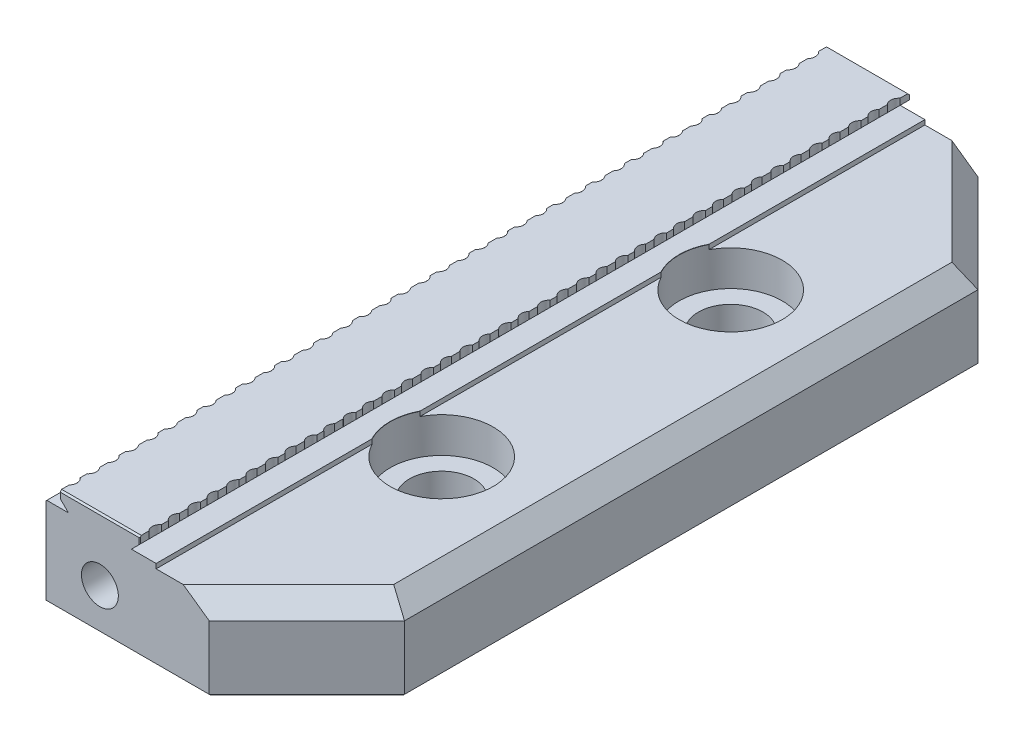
from build123d import *

# Parameters (mm, degrees)
BOSS_EXTRUDE1_DEPTH                = 62.5
CUT_EXTRUDE1_JAW_TOOTH_REACH       = 70.214
LPATTERN1_COUNT                    = 20
LPATTERN1_PITCH                    = 6.31952
CBORE_FOR_M10_SHCS1_AT_2_COUNT     = 2
CBORE_FOR_M10_SHCS1_AT_2_PITCH     = 46.99
F_6_0MM_DOWEL_HOLE1_D              = 8.0127
F_6_0MM_DOWEL_HOLE1_DEPTH          = 6.858
SKETCH20_W                         = 24.511
SKETCH20_H                         = 125
CUT_EXTRUDE4_DEPTH                 = 0.762
CHAMFER1_SIZE                      = 15.875
CHAMFER2_SIZE                      = 0.254
OUTSIDE_DOVETAIL_CHAMFER_SIZE      = 0.508
BOTTOM_OUTSIDE_EDGE_CHAMFER_SIZE   = 0.381
OUTSIDE_JAW_FACE_EDGE_CHAMFER_SIZE = 0.381
FRONT_JAW_FACE_CHAMFERED_EDGE_SIZE = 0.381
CHAMFER3_SIZE                      = 3


with BuildPart() as part:
    # Sketch1 → Boss-Extrude1 (new, symmetric)
    with BuildSketch(Plane.XY):
        Polygon((-21.3995, -8.5), (21.3995, -8.5), (21.3995, 4.2), (21.3995, 6), (-3.1115, 6), (-7.1355, 6), (-5.6515, 7.484), (-5.6515, 8.5), (-18.8595, 8.5), (-18.8595, 7.484), (-17.3755, 6), (-21.3995, 6), align=None)
    extrude(amount=BOSS_EXTRUDE1_DEPTH, both=True)

    # Sketch8 → Cut-Extrude1 JAW TOOTH (cut, up to next)
    with BuildSketch(Plane(origin=(0, 8.5, 0), x_dir=(1, 0, 0), z_dir=(0, 1, 0)), mode=Mode.PRIVATE) as cut_extrude1_jaw_tooth_sk1:
        with BuildLine():
            Line((-18.8595, 62.5), (-18.8595, 60.976))
            ThreePointArc((-18.8595, 60.976), (-18.380440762, 60.048590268), (-18.7325, 59.06592))
            Line((-18.7325, 59.06592), (-18.7325, 57.67908))
            ThreePointArc((-18.7325, 57.67908), (-18.380440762, 56.696409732), (-18.8595, 55.769))
            Line((-18.8595, 55.769), (-21.598870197, 55.769))
            Line((-21.598870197, 55.769), (-21.598870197, 62.5))
            Line((-21.598870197, 62.5), (-18.8595, 62.5))
        make_face()
    cut_extrude1_jaw_tooth_tool1 = extrude(cut_extrude1_jaw_tooth_sk1.sketch, amount=-CUT_EXTRUDE1_JAW_TOOTH_REACH, mode=Mode.PRIVATE) & part.part
    # Sketch8 → Cut-Extrude1 JAW TOOTH (cut, up to next)
    with BuildSketch(Plane(origin=(0, 8.5, 0), x_dir=(1, 0, 0), z_dir=(0, 1, 0)), mode=Mode.PRIVATE) as cut_extrude1_jaw_tooth_sk2:
        with BuildLine():
            Line((-2.912129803, 62.5), (-5.6515, 62.5))
            Line((-5.6515, 62.5), (-5.6515, 60.976))
            ThreePointArc((-5.6515, 60.976), (-6.130559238, 60.048590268), (-5.7785, 59.06592))
            Line((-5.7785, 59.06592), (-5.7785, 57.67908))
            ThreePointArc((-5.7785, 57.67908), (-6.130559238, 56.696409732), (-5.6515, 55.769))
            Line((-5.6515, 55.769), (-2.912129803, 55.769))
            Line((-2.912129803, 55.769), (-2.912129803, 62.5))
        make_face()
    cut_extrude1_jaw_tooth_tool2 = extrude(cut_extrude1_jaw_tooth_sk2.sketch, amount=-CUT_EXTRUDE1_JAW_TOOTH_REACH, mode=Mode.PRIVATE) & part.part
    cut_extrude1_jaw_tooth_1 = cut_extrude1_jaw_tooth_tool1.solids().sort_by_distance((-20.110914, 8.5, -59.076435))[0]
    add(cut_extrude1_jaw_tooth_1, mode=Mode.SUBTRACT)
    cut_extrude1_jaw_tooth_2 = cut_extrude1_jaw_tooth_tool2.solids().sort_by_distance((-4.400086, 8.5, -59.076435))[0]
    add(cut_extrude1_jaw_tooth_2, mode=Mode.SUBTRACT)
    cut_extrude1_jaw_tooth = cut_extrude1_jaw_tooth_1 + cut_extrude1_jaw_tooth_2  # Cut-Extrude1 JAW TOOTH as one shape, for the pattern or mirror that repeats it

    # LPattern1: Cut-Extrude1 JAW TOOTH ×20
    with Locations(*[(0, 0, i * LPATTERN1_PITCH) for i in range(1, LPATTERN1_COUNT)]):
        add(cut_extrude1_jaw_tooth, mode=Mode.SUBTRACT)

    # Sketch2 → CBORE for M10 SHCS1 (revolve, cut)
    with BuildSketch(Plane(origin=(4.318, 6, -23.495), x_dir=(0, 0, 1), z_dir=(1, 0, 0))):
        Polygon((0, 0), (0, 14.5), (5.25, 14.5), (5.25, 6.5), (8.382, 6.5), (8.382, 0.025), (8.407, 0), align=None)
    cbore_for_m10_shcs1 = revolve(axis=Axis((4.318, 12.35, -23.495), (0, -1, 0)), mode=Mode.SUBTRACT)

    # CBORE for M10 SHCS1 at 2: CBORE for M10 SHCS1 ×2
    with Locations(*[(0, 0, i * CBORE_FOR_M10_SHCS1_AT_2_PITCH) for i in range(1, CBORE_FOR_M10_SHCS1_AT_2_COUNT)]):
        add(cbore_for_m10_shcs1, mode=Mode.SUBTRACT)

    # 6.0mm Dowel Hole1
    with Locations(Plane.XZ.offset(8.5)):
        with Locations((16.018, 23.5), (-7.382, -23.5)):
            Hole(F_6_0MM_DOWEL_HOLE1_D / 2, depth=F_6_0MM_DOWEL_HOLE1_DEPTH)

    # Sketch20 → Cut-Extrude4 (cut)
    with BuildSketch(Plane(origin=(0, 6, 0), x_dir=(1, 0, 0), z_dir=(0, 1, 0))):
        with Locations((9.144, 0)):
            Rectangle(SKETCH20_W, SKETCH20_H)
    extrude(amount=-CUT_EXTRUDE4_DEPTH, mode=Mode.SUBTRACT)

    # Chamfer1
    chamfer1_edges = [part.edges().sort_by_distance(p)[0] for p in [
        (21.3995, -1.631, 62.5),
        (21.3995, -1.631, -62.5),
    ]]
    chamfer(chamfer1_edges, length=CHAMFER1_SIZE)

    # Chamfer2
    chamfer2_edges = [part.edges().sort_by_distance(p)[0] for p in [
        (-12.2555, 8.5, -62.5),
        (-12.2555, 8.5, 62.5),
    ]]
    chamfer(chamfer2_edges, length=CHAMFER2_SIZE)

    # Sketch13 → M6x1.0 Tapped Hole1 (revolve, cut)
    with BuildSketch(Plane(origin=(-12.2555, -1.66, -62.5), x_dir=(0, 1, 0), z_dir=(1, 0, 0))):
        Polygon((0, 0), (0, 16.488151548), (2.5, 14.986), (2.5, 11.9888), (3, 11.9888), (3, 0), align=None)
    m6x1_0_tapped_hole1 = revolve(axis=Axis((-12.2555, -1.66, -68.85), (0, 0, 1)), mode=Mode.SUBTRACT)

    # Mirror1: M6x1.0 Tapped Hole1 across plane
    add(m6x1_0_tapped_hole1.mirror(Plane.XY), mode=Mode.SUBTRACT)

    # OUTSIDE DOVETAIL CHAMFER
    outside_dovetail_chamfer_edges = [part.edges().sort_by_distance(p)[0] for p in [
        (-21.3995, 6, 0),
    ]]
    chamfer(outside_dovetail_chamfer_edges, length=OUTSIDE_DOVETAIL_CHAMFER_SIZE)

    # BOTTOM OUTSIDE EDGE CHAMFER
    bottom_outside_edge_chamfer_edges = [part.edges().sort_by_distance(p)[0] for p in [
        (-7.9375, -8.5, -62.5),
        (21.3995, -8.5, 0),
        (13.462, -8.5, 54.5625),
        (13.462, -8.5, -54.5625),
        (-7.9375, -8.5, 62.5),
    ]]
    chamfer(bottom_outside_edge_chamfer_edges, length=BOTTOM_OUTSIDE_EDGE_CHAMFER_SIZE)

    # OUTSIDE JAW FACE EDGE CHAMFER
    outside_jaw_face_edge_chamfer_edges = [part.edges().sort_by_distance(p)[0] for p in [
        (-21.3995, -1.3135, -62.5),
        (-21.3995, -1.3135, 62.5),
    ]]
    chamfer(outside_jaw_face_edge_chamfer_edges, length=OUTSIDE_JAW_FACE_EDGE_CHAMFER_SIZE)

    # FRONT JAW FACE CHAMFERED EDGE
    front_jaw_face_chamfered_edge_edges = [part.edges().sort_by_distance(p)[0] for p in [
        (-21.3995, -8.5, 0),
    ]]
    chamfer(front_jaw_face_chamfered_edge_edges, length=FRONT_JAW_FACE_CHAMFERED_EDGE_SIZE)

    # Chamfer3
    chamfer3_edges = [part.edges().sort_by_distance(p)[0] for p in [
        (21.3995, 5.238, 0),
        (13.462, 5.238, 54.5625),
        (13.462, 5.238, -54.5625),
    ]]
    chamfer(chamfer3_edges, length=CHAMFER3_SIZE)


solid = part.part
